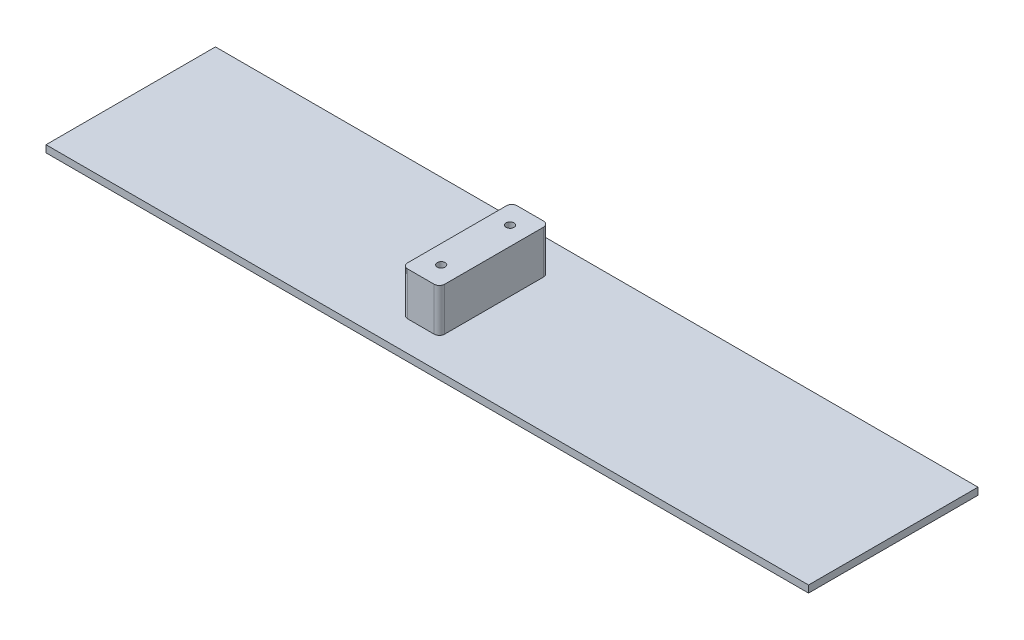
ISO-10303-21;
HEADER;
FILE_DESCRIPTION(('STEP AP214'),'2;1');
FILE_NAME('part.step','',(''),(''),'','','');
FILE_SCHEMA(('AUTOMOTIVE_DESIGN { 1 0 10303 214 1 1 1 1 }'));
ENDSEC;
DATA;
#1=APPLICATION_CONTEXT('core data for automotive mechanical design processes');
#2=APPLICATION_PROTOCOL_DEFINITION('international standard','automotive_design',2000,#1);
#3=PRODUCT_CONTEXT('',#1,'mechanical');
#4=PRODUCT('Part','Part','',(#3));
#5=PRODUCT_RELATED_PRODUCT_CATEGORY('part','',(#4));
#6=PRODUCT_DEFINITION_FORMATION('','',#4);
#7=PRODUCT_DEFINITION_CONTEXT('part definition',#1,'design');
#8=PRODUCT_DEFINITION('design','',#6,#7);
#9=PRODUCT_DEFINITION_SHAPE('','',#8);
#10=(LENGTH_UNIT() NAMED_UNIT(*) SI_UNIT(.MILLI.,.METRE.));
#11=(NAMED_UNIT(*) PLANE_ANGLE_UNIT() SI_UNIT($,.RADIAN.));
#12=(NAMED_UNIT(*) SI_UNIT($,.STERADIAN.) SOLID_ANGLE_UNIT());
#13=UNCERTAINTY_MEASURE_WITH_UNIT(LENGTH_MEASURE(1.E-05),#10,'distance_accuracy_value','');
#14=(GEOMETRIC_REPRESENTATION_CONTEXT(3) GLOBAL_UNCERTAINTY_ASSIGNED_CONTEXT((#13)) GLOBAL_UNIT_ASSIGNED_CONTEXT((#10,
#11,#12)) REPRESENTATION_CONTEXT('',''));
#15=CARTESIAN_POINT('',(0.,0.,0.));
#16=DIRECTION('',(0.,0.,1.));
#17=DIRECTION('',(1.,0.,0.));
#18=AXIS2_PLACEMENT_3D('',#15,#16,#17);
#19=CARTESIAN_POINT('',(-685.8,0.,152.4));
#20=DIRECTION('',(0.,1.,0.));
#21=DIRECTION('',(0.,0.,1.));
#22=AXIS2_PLACEMENT_3D('',#19,#20,#21);
#23=PLANE('',#22);
#24=DIRECTION('',(0.,0.,1.));
#25=VECTOR('',#24,1.);
#26=CARTESIAN_POINT('',(-685.8,0.,-152.4));
#27=LINE('',#26,#25);
#28=CARTESIAN_POINT('',(-685.8,0.,-152.4));
#29=VERTEX_POINT('',#28);
#30=CARTESIAN_POINT('',(-685.8,0.,152.4));
#31=VERTEX_POINT('',#30);
#32=EDGE_CURVE('E201',#29,#31,#27,.T.);
#33=ORIENTED_EDGE('',*,*,#32,.T.);
#34=DIRECTION('',(1.,0.,0.));
#35=VECTOR('',#34,1.);
#36=CARTESIAN_POINT('',(-685.8,0.,152.4));
#37=LINE('',#36,#35);
#38=CARTESIAN_POINT('',(685.8,0.,152.4));
#39=VERTEX_POINT('',#38);
#40=EDGE_CURVE('E216',#31,#39,#37,.T.);
#41=ORIENTED_EDGE('',*,*,#40,.T.);
#42=DIRECTION('',(0.,0.,-1.));
#43=VECTOR('',#42,1.);
#44=CARTESIAN_POINT('',(685.8,0.,-152.4));
#45=LINE('',#44,#43);
#46=CARTESIAN_POINT('',(685.8,0.,-152.4));
#47=VERTEX_POINT('',#46);
#48=EDGE_CURVE('E219',#39,#47,#45,.T.);
#49=ORIENTED_EDGE('',*,*,#48,.T.);
#50=DIRECTION('',(-1.,0.,0.));
#51=VECTOR('',#50,1.);
#52=CARTESIAN_POINT('',(-685.8,0.,-152.4));
#53=LINE('',#52,#51);
#54=EDGE_CURVE('E207',#47,#29,#53,.T.);
#55=ORIENTED_EDGE('',*,*,#54,.T.);
#56=EDGE_LOOP('',(#33,#41,#49,#55));
#57=FACE_BOUND('',#56,.T.);
#58=CARTESIAN_POINT('',(-41.672937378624,0.,88.9));
#59=DIRECTION('',(0.,1.,0.));
#60=DIRECTION('',(0.,0.,1.));
#61=AXIS2_PLACEMENT_3D('',#58,#59,#60);
#62=CIRCLE('',#61,9.525);
#63=CARTESIAN_POINT('',(-41.672937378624,0.,98.425));
#64=VERTEX_POINT('',#63);
#65=CARTESIAN_POINT('',(-32.147937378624,0.,88.9));
#66=VERTEX_POINT('',#65);
#67=EDGE_CURVE('E144',#64,#66,#62,.T.);
#68=ORIENTED_EDGE('',*,*,#67,.F.);
#69=DIRECTION('',(1.,0.,0.));
#70=VECTOR('',#69,1.);
#71=CARTESIAN_POINT('',(-89.297937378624,0.,98.4250000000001));
#72=LINE('',#71,#70);
#73=CARTESIAN_POINT('',(-89.297937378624,0.,98.425));
#74=VERTEX_POINT('',#73);
#75=EDGE_CURVE('E45',#74,#64,#72,.T.);
#76=ORIENTED_EDGE('',*,*,#75,.F.);
#77=CARTESIAN_POINT('',(-89.297937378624,0.,88.9));
#78=DIRECTION('',(0.,1.,0.));
#79=DIRECTION('',(0.,0.,1.));
#80=AXIS2_PLACEMENT_3D('',#77,#78,#79);
#81=CIRCLE('',#80,9.525);
#82=CARTESIAN_POINT('',(-98.822937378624,0.,88.9));
#83=VERTEX_POINT('',#82);
#84=EDGE_CURVE('E185',#83,#74,#81,.T.);
#85=ORIENTED_EDGE('',*,*,#84,.F.);
#86=DIRECTION('',(0.,0.,1.));
#87=VECTOR('',#86,1.);
#88=CARTESIAN_POINT('',(-98.822937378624,0.,-88.8999999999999));
#89=LINE('',#88,#87);
#90=CARTESIAN_POINT('',(-98.822937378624,0.,-88.8999999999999));
#91=VERTEX_POINT('',#90);
#92=EDGE_CURVE('E182',#91,#83,#89,.T.);
#93=ORIENTED_EDGE('',*,*,#92,.F.);
#94=CARTESIAN_POINT('',(-89.297937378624,0.,-88.9));
#95=DIRECTION('',(0.,1.,0.));
#96=DIRECTION('',(0.,0.,1.));
#97=AXIS2_PLACEMENT_3D('',#94,#95,#96);
#98=CIRCLE('',#97,9.525);
#99=CARTESIAN_POINT('',(-89.297937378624,0.,-98.425));
#100=VERTEX_POINT('',#99);
#101=EDGE_CURVE('E179',#100,#91,#98,.T.);
#102=ORIENTED_EDGE('',*,*,#101,.F.);
#103=DIRECTION('',(-1.,0.,0.));
#104=VECTOR('',#103,1.);
#105=CARTESIAN_POINT('',(-41.672937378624,0.,-98.425));
#106=LINE('',#105,#104);
#107=CARTESIAN_POINT('',(-41.672937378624,0.,-98.425));
#108=VERTEX_POINT('',#107);
#109=EDGE_CURVE('E176',#108,#100,#106,.T.);
#110=ORIENTED_EDGE('',*,*,#109,.F.);
#111=CARTESIAN_POINT('',(-41.672937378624,0.,-88.9));
#112=DIRECTION('',(0.,1.,0.));
#113=DIRECTION('',(0.,0.,1.));
#114=AXIS2_PLACEMENT_3D('',#111,#112,#113);
#115=CIRCLE('',#114,9.525);
#116=CARTESIAN_POINT('',(-32.147937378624,0.,-88.8999999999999));
#117=VERTEX_POINT('',#116);
#118=EDGE_CURVE('E173',#117,#108,#115,.T.);
#119=ORIENTED_EDGE('',*,*,#118,.F.);
#120=DIRECTION('',(0.,0.,-1.));
#121=VECTOR('',#120,1.);
#122=CARTESIAN_POINT('',(-32.147937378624,0.,88.9));
#123=LINE('',#122,#121);
#124=EDGE_CURVE('E170',#66,#117,#123,.T.);
#125=ORIENTED_EDGE('',*,*,#124,.F.);
#126=EDGE_LOOP('',(#68,#76,#85,#93,#102,#110,#119,#125));
#127=FACE_BOUND('',#126,.T.);
#128=ADVANCED_FACE('F30',(#57,#127),#23,.T.);
#129=CARTESIAN_POINT('',(-685.8,-12.7,-152.4));
#130=DIRECTION('',(-1.,0.,0.));
#131=DIRECTION('',(0.,0.,1.));
#132=AXIS2_PLACEMENT_3D('',#129,#130,#131);
#133=PLANE('',#132);
#134=ORIENTED_EDGE('',*,*,#32,.F.);
#135=DIRECTION('',(0.,1.,0.));
#136=VECTOR('',#135,1.);
#137=CARTESIAN_POINT('',(-685.8,-12.7,-152.4));
#138=LINE('',#137,#136);
#139=CARTESIAN_POINT('',(-685.8,-12.7,-152.4));
#140=VERTEX_POINT('',#139);
#141=EDGE_CURVE('E54',#140,#29,#138,.T.);
#142=ORIENTED_EDGE('',*,*,#141,.F.);
#143=DIRECTION('',(0.,0.,1.));
#144=VECTOR('',#143,1.);
#145=CARTESIAN_POINT('',(-685.8,-12.7,-152.4));
#146=LINE('',#145,#144);
#147=CARTESIAN_POINT('',(-685.8,-12.7,152.4));
#148=VERTEX_POINT('',#147);
#149=EDGE_CURVE('E204',#140,#148,#146,.T.);
#150=ORIENTED_EDGE('',*,*,#149,.T.);
#151=DIRECTION('',(0.,1.,0.));
#152=VECTOR('',#151,1.);
#153=CARTESIAN_POINT('',(-685.8,-12.7,152.4));
#154=LINE('',#153,#152);
#155=EDGE_CURVE('E80',#148,#31,#154,.T.);
#156=ORIENTED_EDGE('',*,*,#155,.T.);
#157=EDGE_LOOP('',(#134,#142,#150,#156));
#158=FACE_BOUND('',#157,.T.);
#159=ADVANCED_FACE('F32',(#158),#133,.T.);
#160=CARTESIAN_POINT('',(-685.8,-12.7,-152.4));
#161=DIRECTION('',(0.,0.,-1.));
#162=DIRECTION('',(-1.,0.,0.));
#163=AXIS2_PLACEMENT_3D('',#160,#161,#162);
#164=PLANE('',#163);
#165=ORIENTED_EDGE('',*,*,#54,.F.);
#166=DIRECTION('',(0.,1.,0.));
#167=VECTOR('',#166,1.);
#168=CARTESIAN_POINT('',(685.8,-12.7,-152.4));
#169=LINE('',#168,#167);
#170=CARTESIAN_POINT('',(685.8,-12.7,-152.4));
#171=VERTEX_POINT('',#170);
#172=EDGE_CURVE('E225',#171,#47,#169,.T.);
#173=ORIENTED_EDGE('',*,*,#172,.F.);
#174=DIRECTION('',(-1.,0.,0.));
#175=VECTOR('',#174,1.);
#176=CARTESIAN_POINT('',(-685.8,-12.7,-152.4));
#177=LINE('',#176,#175);
#178=EDGE_CURVE('E212',#171,#140,#177,.T.);
#179=ORIENTED_EDGE('',*,*,#178,.T.);
#180=ORIENTED_EDGE('',*,*,#141,.T.);
#181=EDGE_LOOP('',(#165,#173,#179,#180));
#182=FACE_BOUND('',#181,.T.);
#183=ADVANCED_FACE('F253',(#182),#164,.T.);
#184=CARTESIAN_POINT('',(685.8,-12.7,-152.4));
#185=DIRECTION('',(1.,0.,0.));
#186=DIRECTION('',(0.,0.,-1.));
#187=AXIS2_PLACEMENT_3D('',#184,#185,#186);
#188=PLANE('',#187);
#189=ORIENTED_EDGE('',*,*,#48,.F.);
#190=DIRECTION('',(0.,1.,0.));
#191=VECTOR('',#190,1.);
#192=CARTESIAN_POINT('',(685.8,-12.7,152.4));
#193=LINE('',#192,#191);
#194=CARTESIAN_POINT('',(685.8,-12.7,152.4));
#195=VERTEX_POINT('',#194);
#196=EDGE_CURVE('E227',#195,#39,#193,.T.);
#197=ORIENTED_EDGE('',*,*,#196,.F.);
#198=DIRECTION('',(0.,0.,-1.));
#199=VECTOR('',#198,1.);
#200=CARTESIAN_POINT('',(685.8,-12.7,-152.4));
#201=LINE('',#200,#199);
#202=EDGE_CURVE('E209',#195,#171,#201,.T.);
#203=ORIENTED_EDGE('',*,*,#202,.T.);
#204=ORIENTED_EDGE('',*,*,#172,.T.);
#205=EDGE_LOOP('',(#189,#197,#203,#204));
#206=FACE_BOUND('',#205,.T.);
#207=ADVANCED_FACE('F305',(#206),#188,.T.);
#208=CARTESIAN_POINT('',(-685.8,-12.7,152.4));
#209=DIRECTION('',(0.,0.,1.));
#210=DIRECTION('',(1.,0.,0.));
#211=AXIS2_PLACEMENT_3D('',#208,#209,#210);
#212=PLANE('',#211);
#213=ORIENTED_EDGE('',*,*,#40,.F.);
#214=ORIENTED_EDGE('',*,*,#155,.F.);
#215=DIRECTION('',(1.,0.,0.));
#216=VECTOR('',#215,1.);
#217=CARTESIAN_POINT('',(-685.8,-12.7,152.4));
#218=LINE('',#217,#216);
#219=EDGE_CURVE('E206',#148,#195,#218,.T.);
#220=ORIENTED_EDGE('',*,*,#219,.T.);
#221=ORIENTED_EDGE('',*,*,#196,.T.);
#222=EDGE_LOOP('',(#213,#214,#220,#221));
#223=FACE_BOUND('',#222,.T.);
#224=ADVANCED_FACE('F300',(#223),#212,.T.);
#225=CARTESIAN_POINT('',(-685.8,-12.7,152.4));
#226=DIRECTION('',(0.,1.,0.));
#227=DIRECTION('',(0.,0.,1.));
#228=AXIS2_PLACEMENT_3D('',#225,#226,#227);
#229=PLANE('',#228);
#230=ORIENTED_EDGE('',*,*,#149,.F.);
#231=ORIENTED_EDGE('',*,*,#178,.F.);
#232=ORIENTED_EDGE('',*,*,#202,.F.);
#233=ORIENTED_EDGE('',*,*,#219,.F.);
#234=EDGE_LOOP('',(#230,#231,#232,#233));
#235=FACE_BOUND('',#234,.T.);
#236=ADVANCED_FACE('F285',(#235),#229,.F.);
#237=CARTESIAN_POINT('',(-89.297937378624,285.622718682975,98.4250000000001));
#238=DIRECTION('',(0.,0.,-1.));
#239=DIRECTION('',(-1.,0.,0.));
#240=AXIS2_PLACEMENT_3D('',#237,#238,#239);
#241=PLANE('',#240);
#242=DIRECTION('',(1.,0.,0.));
#243=VECTOR('',#242,1.);
#244=CARTESIAN_POINT('',(-89.297937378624,77.7875,98.4250000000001));
#245=LINE('',#244,#243);
#246=CARTESIAN_POINT('',(-89.297937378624,77.7875,98.425));
#247=VERTEX_POINT('',#246);
#248=CARTESIAN_POINT('',(-41.672937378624,77.7875,98.425));
#249=VERTEX_POINT('',#248);
#250=EDGE_CURVE('E130',#247,#249,#245,.T.);
#251=ORIENTED_EDGE('',*,*,#250,.F.);
#252=DIRECTION('',(0.,-1.,0.));
#253=VECTOR('',#252,1.);
#254=CARTESIAN_POINT('',(-89.297937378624,285.622718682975,98.425));
#255=LINE('',#254,#253);
#256=EDGE_CURVE('E135',#247,#74,#255,.T.);
#257=ORIENTED_EDGE('',*,*,#256,.T.);
#258=ORIENTED_EDGE('',*,*,#75,.T.);
#259=DIRECTION('',(0.,-1.,0.));
#260=VECTOR('',#259,1.);
#261=CARTESIAN_POINT('',(-41.672937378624,285.622718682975,98.425));
#262=LINE('',#261,#260);
#263=EDGE_CURVE('E126',#249,#64,#262,.T.);
#264=ORIENTED_EDGE('',*,*,#263,.F.);
#265=EDGE_LOOP('',(#251,#257,#258,#264));
#266=FACE_BOUND('',#265,.T.);
#267=ADVANCED_FACE('F128',(#266),#241,.F.);
#268=CARTESIAN_POINT('',(-89.297937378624,285.622718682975,88.9));
#269=DIRECTION('',(0.,-1.,0.));
#270=DIRECTION('',(0.,0.,-1.));
#271=AXIS2_PLACEMENT_3D('',#268,#269,#270);
#272=CYLINDRICAL_SURFACE('',#271,9.525);
#273=CARTESIAN_POINT('',(-89.297937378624,77.7875,88.9));
#274=DIRECTION('',(0.,1.,0.));
#275=DIRECTION('',(0.,0.,1.));
#276=AXIS2_PLACEMENT_3D('',#273,#274,#275);
#277=CIRCLE('',#276,9.525);
#278=CARTESIAN_POINT('',(-98.822937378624,77.7875,88.9));
#279=VERTEX_POINT('',#278);
#280=EDGE_CURVE('E149',#279,#247,#277,.T.);
#281=ORIENTED_EDGE('',*,*,#280,.F.);
#282=DIRECTION('',(0.,-1.,0.));
#283=VECTOR('',#282,1.);
#284=CARTESIAN_POINT('',(-98.822937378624,285.622718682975,88.9));
#285=LINE('',#284,#283);
#286=EDGE_CURVE('E190',#279,#83,#285,.T.);
#287=ORIENTED_EDGE('',*,*,#286,.T.);
#288=ORIENTED_EDGE('',*,*,#84,.T.);
#289=ORIENTED_EDGE('',*,*,#256,.F.);
#290=EDGE_LOOP('',(#281,#287,#288,#289));
#291=FACE_BOUND('',#290,.T.);
#292=ADVANCED_FACE('F277',(#291),#272,.T.);
#293=CARTESIAN_POINT('',(-98.822937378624,285.622718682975,-88.8999999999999));
#294=DIRECTION('',(1.,0.,0.));
#295=DIRECTION('',(0.,0.,-1.));
#296=AXIS2_PLACEMENT_3D('',#293,#294,#295);
#297=PLANE('',#296);
#298=DIRECTION('',(0.,0.,1.));
#299=VECTOR('',#298,1.);
#300=CARTESIAN_POINT('',(-98.822937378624,77.7875,-88.8999999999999));
#301=LINE('',#300,#299);
#302=CARTESIAN_POINT('',(-98.822937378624,77.7875,-88.8999999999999));
#303=VERTEX_POINT('',#302);
#304=EDGE_CURVE('E152',#303,#279,#301,.T.);
#305=ORIENTED_EDGE('',*,*,#304,.F.);
#306=DIRECTION('',(0.,-1.,0.));
#307=VECTOR('',#306,1.);
#308=CARTESIAN_POINT('',(-98.822937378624,285.622718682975,-88.8999999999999));
#309=LINE('',#308,#307);
#310=EDGE_CURVE('E192',#303,#91,#309,.T.);
#311=ORIENTED_EDGE('',*,*,#310,.T.);
#312=ORIENTED_EDGE('',*,*,#92,.T.);
#313=ORIENTED_EDGE('',*,*,#286,.F.);
#314=EDGE_LOOP('',(#305,#311,#312,#313));
#315=FACE_BOUND('',#314,.T.);
#316=ADVANCED_FACE('F275',(#315),#297,.F.);
#317=CARTESIAN_POINT('',(-89.297937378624,285.622718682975,-88.9));
#318=DIRECTION('',(0.,-1.,0.));
#319=DIRECTION('',(0.,0.,-1.));
#320=AXIS2_PLACEMENT_3D('',#317,#318,#319);
#321=CYLINDRICAL_SURFACE('',#320,9.525);
#322=CARTESIAN_POINT('',(-89.297937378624,77.7875,-88.9));
#323=DIRECTION('',(0.,1.,0.));
#324=DIRECTION('',(0.,0.,1.));
#325=AXIS2_PLACEMENT_3D('',#322,#323,#324);
#326=CIRCLE('',#325,9.525);
#327=CARTESIAN_POINT('',(-89.297937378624,77.7875,-98.425));
#328=VERTEX_POINT('',#327);
#329=EDGE_CURVE('E159',#328,#303,#326,.T.);
#330=ORIENTED_EDGE('',*,*,#329,.F.);
#331=DIRECTION('',(0.,-1.,0.));
#332=VECTOR('',#331,1.);
#333=CARTESIAN_POINT('',(-89.297937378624,285.622718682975,-98.425));
#334=LINE('',#333,#332);
#335=EDGE_CURVE('E194',#328,#100,#334,.T.);
#336=ORIENTED_EDGE('',*,*,#335,.T.);
#337=ORIENTED_EDGE('',*,*,#101,.T.);
#338=ORIENTED_EDGE('',*,*,#310,.F.);
#339=EDGE_LOOP('',(#330,#336,#337,#338));
#340=FACE_BOUND('',#339,.T.);
#341=ADVANCED_FACE('F270',(#340),#321,.T.);
#342=CARTESIAN_POINT('',(-41.672937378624,285.622718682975,-98.425));
#343=DIRECTION('',(0.,0.,1.));
#344=DIRECTION('',(1.,0.,0.));
#345=AXIS2_PLACEMENT_3D('',#342,#343,#344);
#346=PLANE('',#345);
#347=DIRECTION('',(-1.,0.,0.));
#348=VECTOR('',#347,1.);
#349=CARTESIAN_POINT('',(-41.672937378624,77.7875,-98.425));
#350=LINE('',#349,#348);
#351=CARTESIAN_POINT('',(-41.672937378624,77.7875,-98.425));
#352=VERTEX_POINT('',#351);
#353=EDGE_CURVE('E162',#352,#328,#350,.T.);
#354=ORIENTED_EDGE('',*,*,#353,.F.);
#355=DIRECTION('',(0.,-1.,0.));
#356=VECTOR('',#355,1.);
#357=CARTESIAN_POINT('',(-41.672937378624,285.622718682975,-98.425));
#358=LINE('',#357,#356);
#359=EDGE_CURVE('E196',#352,#108,#358,.T.);
#360=ORIENTED_EDGE('',*,*,#359,.T.);
#361=ORIENTED_EDGE('',*,*,#109,.T.);
#362=ORIENTED_EDGE('',*,*,#335,.F.);
#363=EDGE_LOOP('',(#354,#360,#361,#362));
#364=FACE_BOUND('',#363,.T.);
#365=ADVANCED_FACE('F266',(#364),#346,.F.);
#366=CARTESIAN_POINT('',(-41.672937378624,285.622718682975,-88.9));
#367=DIRECTION('',(0.,-1.,0.));
#368=DIRECTION('',(0.,0.,-1.));
#369=AXIS2_PLACEMENT_3D('',#366,#367,#368);
#370=CYLINDRICAL_SURFACE('',#369,9.525);
#371=CARTESIAN_POINT('',(-41.672937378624,77.7875,-88.9));
#372=DIRECTION('',(0.,1.,0.));
#373=DIRECTION('',(0.,0.,1.));
#374=AXIS2_PLACEMENT_3D('',#371,#372,#373);
#375=CIRCLE('',#374,9.525);
#376=CARTESIAN_POINT('',(-32.147937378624,77.7875,-88.8999999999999));
#377=VERTEX_POINT('',#376);
#378=EDGE_CURVE('E165',#377,#352,#375,.T.);
#379=ORIENTED_EDGE('',*,*,#378,.F.);
#380=DIRECTION('',(0.,-1.,0.));
#381=VECTOR('',#380,1.);
#382=CARTESIAN_POINT('',(-32.147937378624,285.622718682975,-88.8999999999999));
#383=LINE('',#382,#381);
#384=EDGE_CURVE('E198',#377,#117,#383,.T.);
#385=ORIENTED_EDGE('',*,*,#384,.T.);
#386=ORIENTED_EDGE('',*,*,#118,.T.);
#387=ORIENTED_EDGE('',*,*,#359,.F.);
#388=EDGE_LOOP('',(#379,#385,#386,#387));
#389=FACE_BOUND('',#388,.T.);
#390=ADVANCED_FACE('F264',(#389),#370,.T.);
#391=CARTESIAN_POINT('',(-32.147937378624,285.622718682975,88.9));
#392=DIRECTION('',(-1.,0.,0.));
#393=DIRECTION('',(0.,0.,1.));
#394=AXIS2_PLACEMENT_3D('',#391,#392,#393);
#395=PLANE('',#394);
#396=DIRECTION('',(0.,0.,-1.));
#397=VECTOR('',#396,1.);
#398=CARTESIAN_POINT('',(-32.147937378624,77.7875,88.9));
#399=LINE('',#398,#397);
#400=CARTESIAN_POINT('',(-32.147937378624,77.7875,88.9));
#401=VERTEX_POINT('',#400);
#402=EDGE_CURVE('E145',#401,#377,#399,.T.);
#403=ORIENTED_EDGE('',*,*,#402,.F.);
#404=DIRECTION('',(0.,-1.,0.));
#405=VECTOR('',#404,1.);
#406=CARTESIAN_POINT('',(-32.147937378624,285.622718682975,88.9));
#407=LINE('',#406,#405);
#408=EDGE_CURVE('E141',#401,#66,#407,.T.);
#409=ORIENTED_EDGE('',*,*,#408,.T.);
#410=ORIENTED_EDGE('',*,*,#124,.T.);
#411=ORIENTED_EDGE('',*,*,#384,.F.);
#412=EDGE_LOOP('',(#403,#409,#410,#411));
#413=FACE_BOUND('',#412,.T.);
#414=ADVANCED_FACE('F261',(#413),#395,.F.);
#415=CARTESIAN_POINT('',(-41.672937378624,285.622718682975,88.9));
#416=DIRECTION('',(0.,-1.,0.));
#417=DIRECTION('',(0.,0.,-1.));
#418=AXIS2_PLACEMENT_3D('',#415,#416,#417);
#419=CYLINDRICAL_SURFACE('',#418,9.525);
#420=CARTESIAN_POINT('',(-41.672937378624,77.7875,88.9));
#421=DIRECTION('',(0.,1.,0.));
#422=DIRECTION('',(0.,0.,1.));
#423=AXIS2_PLACEMENT_3D('',#420,#421,#422);
#424=CIRCLE('',#423,9.525);
#425=EDGE_CURVE('E139',#249,#401,#424,.T.);
#426=ORIENTED_EDGE('',*,*,#425,.F.);
#427=ORIENTED_EDGE('',*,*,#263,.T.);
#428=ORIENTED_EDGE('',*,*,#67,.T.);
#429=ORIENTED_EDGE('',*,*,#408,.F.);
#430=EDGE_LOOP('',(#426,#427,#428,#429));
#431=FACE_BOUND('',#430,.T.);
#432=ADVANCED_FACE('F140',(#431),#419,.T.);
#433=CARTESIAN_POINT('',(-65.485437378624,285.622718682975,61.9125));
#434=DIRECTION('',(0.,-1.,0.));
#435=DIRECTION('',(0.,0.,-1.));
#436=AXIS2_PLACEMENT_3D('',#433,#434,#435);
#437=CYLINDRICAL_SURFACE('',#436,7.14375);
#438=CARTESIAN_POINT('',(-65.485437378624,0.,61.9125));
#439=DIRECTION('',(0.,1.,0.));
#440=DIRECTION('',(0.,0.,1.));
#441=AXIS2_PLACEMENT_3D('',#438,#439,#440);
#442=CIRCLE('',#441,7.14375);
#443=CARTESIAN_POINT('',(-65.485437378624,0.,69.05625));
#444=VERTEX_POINT('',#443);
#445=EDGE_CURVE('E11',#444,#444,#442,.F.);
#446=ORIENTED_EDGE('',*,*,#445,.T.);
#447=EDGE_LOOP('',(#446));
#448=FACE_BOUND('',#447,.T.);
#449=CARTESIAN_POINT('',(-65.485437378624,77.7875,61.9125));
#450=DIRECTION('',(0.,1.,0.));
#451=DIRECTION('',(0.,0.,1.));
#452=AXIS2_PLACEMENT_3D('',#449,#450,#451);
#453=CIRCLE('',#452,7.14375);
#454=CARTESIAN_POINT('',(-65.485437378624,77.7875,69.05625));
#455=VERTEX_POINT('',#454);
#456=EDGE_CURVE('E150',#455,#455,#453,.T.);
#457=ORIENTED_EDGE('',*,*,#456,.T.);
#458=EDGE_LOOP('',(#457));
#459=FACE_BOUND('',#458,.T.);
#460=ADVANCED_FACE('F298',(#448,#459),#437,.F.);
#461=CARTESIAN_POINT('',(-65.485437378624,285.622718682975,-61.9124999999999));
#462=DIRECTION('',(0.,-1.,0.));
#463=DIRECTION('',(0.,0.,-1.));
#464=AXIS2_PLACEMENT_3D('',#461,#462,#463);
#465=CYLINDRICAL_SURFACE('',#464,7.14375);
#466=CARTESIAN_POINT('',(-65.485437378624,0.,-61.9124999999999));
#467=DIRECTION('',(0.,1.,0.));
#468=DIRECTION('',(0.,0.,1.));
#469=AXIS2_PLACEMENT_3D('',#466,#467,#468);
#470=CIRCLE('',#469,7.14375);
#471=CARTESIAN_POINT('',(-65.485437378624,0.,-54.7687499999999));
#472=VERTEX_POINT('',#471);
#473=EDGE_CURVE('E38',#472,#472,#470,.F.);
#474=ORIENTED_EDGE('',*,*,#473,.T.);
#475=EDGE_LOOP('',(#474));
#476=FACE_BOUND('',#475,.T.);
#477=CARTESIAN_POINT('',(-65.485437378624,77.7875,-61.9124999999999));
#478=DIRECTION('',(0.,1.,0.));
#479=DIRECTION('',(0.,0.,1.));
#480=AXIS2_PLACEMENT_3D('',#477,#478,#479);
#481=CIRCLE('',#480,7.14375);
#482=CARTESIAN_POINT('',(-65.485437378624,77.7875,-54.7687499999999));
#483=VERTEX_POINT('',#482);
#484=EDGE_CURVE('E155',#483,#483,#481,.T.);
#485=ORIENTED_EDGE('',*,*,#484,.T.);
#486=EDGE_LOOP('',(#485));
#487=FACE_BOUND('',#486,.T.);
#488=ADVANCED_FACE('F232',(#476,#487),#465,.F.);
#489=CARTESIAN_POINT('',(-38.497937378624,77.7875,92.075));
#490=DIRECTION('',(0.,1.,0.));
#491=DIRECTION('',(0.,0.,1.));
#492=AXIS2_PLACEMENT_3D('',#489,#490,#491);
#493=PLANE('',#492);
#494=ORIENTED_EDGE('',*,*,#484,.F.);
#495=EDGE_LOOP('',(#494));
#496=FACE_BOUND('',#495,.T.);
#497=ORIENTED_EDGE('',*,*,#456,.F.);
#498=EDGE_LOOP('',(#497));
#499=FACE_BOUND('',#498,.T.);
#500=ORIENTED_EDGE('',*,*,#250,.T.);
#501=ORIENTED_EDGE('',*,*,#425,.T.);
#502=ORIENTED_EDGE('',*,*,#402,.T.);
#503=ORIENTED_EDGE('',*,*,#378,.T.);
#504=ORIENTED_EDGE('',*,*,#353,.T.);
#505=ORIENTED_EDGE('',*,*,#329,.T.);
#506=ORIENTED_EDGE('',*,*,#304,.T.);
#507=ORIENTED_EDGE('',*,*,#280,.T.);
#508=EDGE_LOOP('',(#500,#501,#502,#503,#504,#505,#506,#507));
#509=FACE_BOUND('',#508,.T.);
#510=ADVANCED_FACE('F147',(#496,#499,#509),#493,.T.);
#511=ORIENTED_EDGE('',*,*,#473,.F.);
#512=EDGE_LOOP('',(#511));
#513=FACE_BOUND('',#512,.T.);
#514=ADVANCED_FACE('F235',(#513),#23,.T.);
#515=ORIENTED_EDGE('',*,*,#445,.F.);
#516=EDGE_LOOP('',(#515));
#517=FACE_BOUND('',#516,.T.);
#518=ADVANCED_FACE('F237',(#517),#23,.T.);
#519=CLOSED_SHELL('',(#128,#159,#183,#207,#224,#236,#267,#292,#316,#341,#365,#390,#414,#432,
#460,#488,#510,#514,#518));
#520=MANIFOLD_SOLID_BREP('B2',#519);
#521=ADVANCED_BREP_SHAPE_REPRESENTATION('',(#18,#520),#14);
#522=SHAPE_DEFINITION_REPRESENTATION(#9,#521);
ENDSEC;
END-ISO-10303-21;
